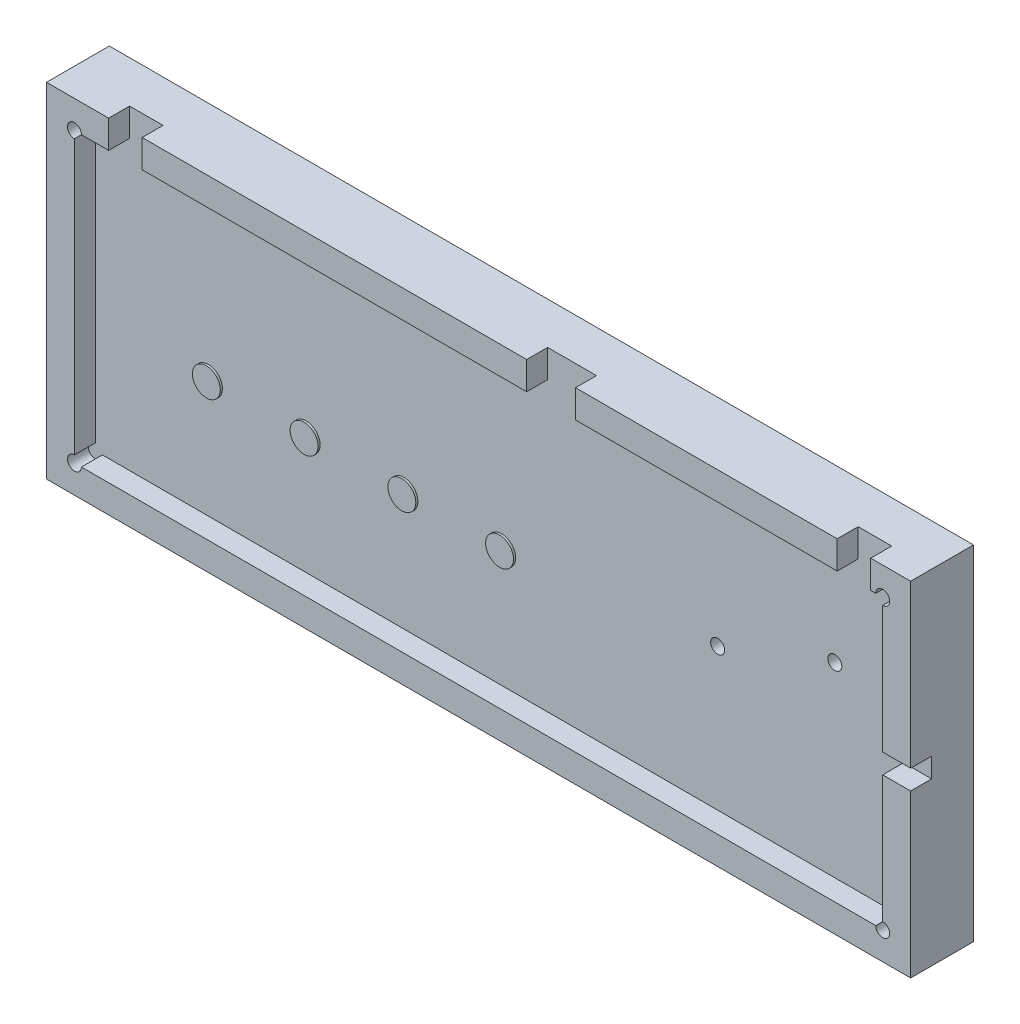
from build123d import *

# Parameters (mm, degrees)
SKETCH1_W          = 135.57
SKETCH1_H          = 61.02
EXTRUDE1_DEPTH     = 5
CUT_EXTRUDE1_DEPTH = 3
SKETCH5_R          = 1
CUT_EXTRUDE2_DEPTH = 3
CUT_EXTRUDE3_REACH = 150.7
SKETCH6_R          = 1
CUT_EXTRUDE4_REACH = 150.754
SKETCH7_W          = 4.8
SKETCH7_H          = 3
CUT_EXTRUDE5_REACH = 150.754
SKETCH8_W          = 4.8
SKETCH8_H          = 3
CUT_EXTRUDE6_REACH = 150.754
SKETCH9_W          = 3
SKETCH9_H          = 2.824621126
SKETCH10_W         = 135.57
SKETCH10_H         = 61.02
SKETCH10_W_2       = 123.77
SKETCH10_H_2       = 49.22
CUT_EXTRUDE7_DEPTH = 149.753706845
SKETCH11_W         = 123.77
SKETCH11_H         = 49.22
SKETCH11_R         = 1.075
SKETCH11_R_2       = 0.988001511
EXTRUDE2_DEPTH     = 4
SKETCH13_R         = 2
EXTRUDE4_DEPTH     = 0.3
LPATTERN2_COUNT    = 4
LPATTERN2_PITCH    = 14
SKETCH14_W         = 7
SKETCH14_H         = 4
CUT_EXTRUDE8_DEPTH = 3


with BuildPart() as part:
    # Sketch1 → Extrude1 (new body)
    with BuildSketch(Plane.XY):
        with Locations((67.785, 30.51)):
            Rectangle(SKETCH1_W, SKETCH1_H)
    extrude(amount=EXTRUDE1_DEPTH)

    # Sketch3 → Cut-Extrude1 (cut)
    with BuildSketch(Plane.XY.offset(5)):
        Polygon((9.9, 51.12), (77.09, 51.12), (125.67, 51.12), (125.67, 9.9), (77.09, 9.9), (9.9, 9.9), align=None)
    extrude(amount=-CUT_EXTRUDE1_DEPTH, mode=Mode.SUBTRACT)

    # Sketch5 → Cut-Extrude2 (cut)
    with BuildSketch(Plane.XY.offset(5)):
        with Locations((125.67, 51.12)):
            Circle(SKETCH5_R)
        with Locations((9.9, 51.12)):
            Circle(SKETCH5_R)
        with Locations((9.9, 9.9)):
            Circle(SKETCH5_R)
        with Locations((125.67, 9.9)):
            Circle(SKETCH5_R)
    extrude(amount=-CUT_EXTRUDE2_DEPTH, mode=Mode.SUBTRACT)

    # Sketch6 → Cut-Extrude3 (cut, up to next)
    with BuildSketch(Plane.XY.offset(2), mode=Mode.PRIVATE) as cut_extrude3_sk1:
        with Locations((99.02218357, 30.225929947)):
            Circle(SKETCH6_R)
    cut_extrude3_tool1 = extrude(cut_extrude3_sk1.sketch, amount=-CUT_EXTRUDE3_REACH, mode=Mode.PRIVATE) & part.part
    # Sketch6 → Cut-Extrude3 (cut, up to next)
    with BuildSketch(Plane.XY.offset(2), mode=Mode.PRIVATE) as cut_extrude3_sk2:
        with Locations((115.807475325, 36.611846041)):
            Circle(SKETCH6_R)
    cut_extrude3_tool2 = extrude(cut_extrude3_sk2.sketch, amount=-CUT_EXTRUDE3_REACH, mode=Mode.PRIVATE) & part.part
    add(cut_extrude3_tool1.solids().sort_by_distance((99.022184, 30.22593, 2))[0], mode=Mode.SUBTRACT)
    add(cut_extrude3_tool2.solids().sort_by_distance((115.807475, 36.611846, 2))[0], mode=Mode.SUBTRACT)

    # Sketch7 → Cut-Extrude4 (cut, up to next)
    with BuildSketch(Plane(origin=(0, 61.02, 0), x_dir=(-1, 0, 0), z_dir=(0, 1, 0)), mode=Mode.PRIVATE) as cut_extrude4_sk1:
        with Locations((-17.2, 3.5)):
            Rectangle(SKETCH7_W, SKETCH7_H)
    cut_extrude4_tool1 = extrude(cut_extrude4_sk1.sketch, amount=-CUT_EXTRUDE4_REACH, mode=Mode.PRIVATE) & part.part
    add(cut_extrude4_tool1.solids().sort_by_distance((17.2, 61.02, 3.5))[0], mode=Mode.SUBTRACT)

    # Sketch8 → Cut-Extrude5 (cut, up to next)
    with BuildSketch(Plane(origin=(0, 61.02, 0), x_dir=(-1, 0, 0), z_dir=(0, 1, 0)), mode=Mode.PRIVATE) as cut_extrude5_sk1:
        with Locations((-121.55, 3.5)):
            Rectangle(SKETCH8_W, SKETCH8_H)
    cut_extrude5_tool1 = extrude(cut_extrude5_sk1.sketch, amount=-CUT_EXTRUDE5_REACH, mode=Mode.PRIVATE) & part.part
    add(cut_extrude5_tool1.solids().sort_by_distance((121.55, 61.02, 3.5))[0], mode=Mode.SUBTRACT)

    # Sketch9 → Cut-Extrude6 (cut, up to next)
    with BuildSketch(Plane(origin=(135.57, 0, 0), x_dir=(0, 0, -1), z_dir=(1, 0, 0)), mode=Mode.PRIVATE) as cut_extrude6_sk1:
        with Locations((-3.5, 30.51)):
            Rectangle(SKETCH9_W, SKETCH9_H)
    cut_extrude6_tool1 = extrude(cut_extrude6_sk1.sketch, amount=-CUT_EXTRUDE6_REACH, mode=Mode.PRIVATE) & part.part
    add(cut_extrude6_tool1.solids().sort_by_distance((135.57, 30.51, 3.5))[0], mode=Mode.SUBTRACT)

    # Sketch10 → Cut-Extrude7 (cut, through all)
    with BuildSketch(Plane.XY.offset(5)):
        with Locations((67.785, 30.51)):
            Rectangle(SKETCH10_W, SKETCH10_H)
        with Locations((67.785, 30.51)):
            Rectangle(SKETCH10_W_2, SKETCH10_H_2, mode=Mode.SUBTRACT)
    extrude(amount=-CUT_EXTRUDE7_DEPTH, mode=Mode.SUBTRACT)

    # Sketch11 → Extrude2 (add)
    with BuildSketch(Plane(origin=(0, 0, 0), x_dir=(-1, 0, 0), z_dir=(0, 0, -1))):
        with Locations((-67.785, 30.51)):
            Rectangle(SKETCH11_W, SKETCH11_H)
        with Locations((-99.02218357, 30.225929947)):
            Circle(SKETCH11_R, mode=Mode.SUBTRACT)
        with Locations((-115.807475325, 36.611846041)):
            Circle(SKETCH11_R_2, mode=Mode.SUBTRACT)
    extrude(amount=EXTRUDE2_DEPTH)

    # Sketch13 → Extrude4 (add)
    with BuildSketch(Plane.XY.offset(2)):
        with Locations((26.09, 26.71)):
            Circle(SKETCH13_R)
    extrude4 = extrude(amount=EXTRUDE4_DEPTH)

    # LPattern2: Extrude4 ×4
    with Locations(*[(i * LPATTERN2_PITCH, 0, 0) for i in range(1, LPATTERN2_COUNT)]):
        add(extrude4)

    # Sketch14 → Cut-Extrude8 (cut)
    with BuildSketch(Plane.XY.offset(5)):
        with Locations((78.17, 53.12)):
            Rectangle(SKETCH14_W, SKETCH14_H)
    extrude(amount=-CUT_EXTRUDE8_DEPTH, mode=Mode.SUBTRACT)


solid = part.part
